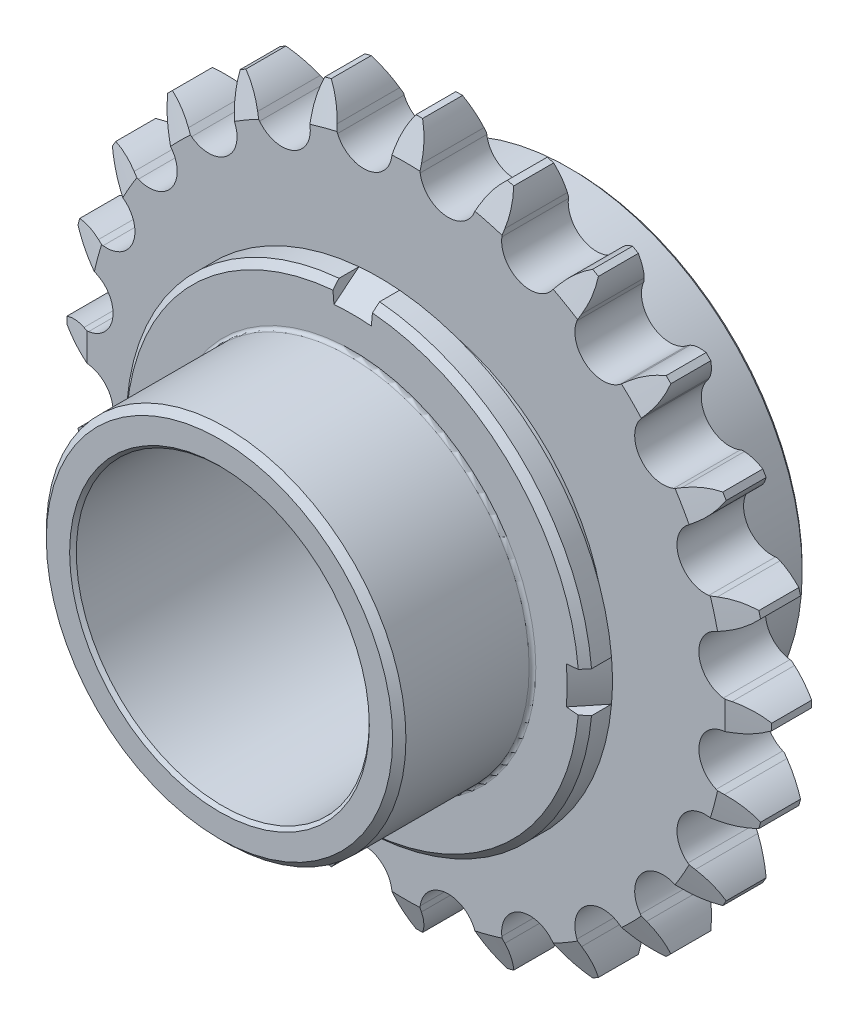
from build123d import *

# Parameters (mm, degrees)
SKETCH2_R                       = 44.394239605
BOSS_EXTRUDE1_DEPTH             = 5
BOSS_EXTRUDE2_REACH             = 64.982
BOSS_EXTRUDE2_DIRECTION_2_REACH = 64.982
CIRPATTERN1_COUNT               = 24
BOSS_EXTRUDE3_DEPTH             = 13
BOSS_EXTRUDE3_DEPTH_BACK        = 20
SKETCH6_R                       = 35
CUT_EXTRUDE1_DEPTH              = 78.467406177
CUT_EXTRUDE1_DEPTH_BACK         = 78.467406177
SKETCH7_R                       = 22
SKETCH9_R                       = 27
SKETCH9_R_2                     = 22
BOSS_EXTRUDE4_DEPTH             = 20
CHAMFER1_SIZE                   = 1
SKETCH10_W                      = 4
SKETCH10_H                      = 10
CUT_REVOLVE9_ANGLE              = 10
CIRPATTERN2_COUNT               = 4
CHAMFER2_SIZE                   = 0.5
FILLET2_R                       = 0.5


with BuildPart() as part:
    # Sketch2 → Boss-Extrude1 (new, symmetric)
    with BuildSketch(Plane.XY):
        Circle(SKETCH2_R)
    extrude(amount=BOSS_EXTRUDE1_DEPTH, both=True)

    # Boss-Extrude2: up to this face of the body (flat: up to its plane)
    boss_extrude2_end = Plane(part.part.faces().sort_by_distance((0, 0, 5))[0])
    # Sketch4 → Boss-Extrude2 (add, up to the picked face)
    with BuildSketch(Plane.XY, mode=Mode.PRIVATE) as boss_extrude2_sk1:
        with BuildLine():
            Line((-0.5, 52.920690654), (0.5, 52.920690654))
            ThreePointArc((0.5, 52.920690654), (1.505944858, 50.872327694), (2.021304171, 48.649239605))
            Line((2.021304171, 48.649239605), (2.13523978, 47.649239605))
            ThreePointArc((2.13523978, 47.649239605), (3.351413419, 45.214180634), (5.794611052, 44.014440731))
            ThreePointArc((5.794611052, 44.014440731), (0, 44.394239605), (-5.794611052, 44.014440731))
            ThreePointArc((-5.794611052, 44.014440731), (-3.351413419, 45.214180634), (-2.13523978, 47.649239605))
            Line((-2.13523978, 47.649239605), (-2.021304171, 48.649239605))
            ThreePointArc((-2.021304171, 48.649239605), (-1.505944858, 50.872327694), (-0.5, 52.920690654))
        make_face()
    boss_extrude2_tool1 = split(extrude(boss_extrude2_sk1.sketch, amount=BOSS_EXTRUDE2_REACH, mode=Mode.PRIVATE), bisect_by=boss_extrude2_end, keep=Keep.BOTH, mode=Mode.PRIVATE)
    boss_extrude2 = boss_extrude2_tool1.solids().sort_by(Axis((0, 47.611932, 0), (0, 0, 1)))[0]
    add(boss_extrude2)

    # Boss-Extrude2 direction 2: up to this face of the body (flat: up to its plane)
    boss_extrude2_direction_2_end = Plane(part.part.faces().sort_by_distance((0, 0, -5))[0])
    # Sketch4 → Boss-Extrude2 direction 2 (add, up to the picked face)
    with BuildSketch(Plane.XY, mode=Mode.PRIVATE) as boss_extrude2_direction_2_sk1:
        with BuildLine():
            Line((-0.5, 52.920690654), (0.5, 52.920690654))
            ThreePointArc((0.5, 52.920690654), (1.505944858, 50.872327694), (2.021304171, 48.649239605))
            Line((2.021304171, 48.649239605), (2.13523978, 47.649239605))
            ThreePointArc((2.13523978, 47.649239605), (3.351413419, 45.214180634), (5.794611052, 44.014440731))
            ThreePointArc((5.794611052, 44.014440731), (0, 44.394239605), (-5.794611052, 44.014440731))
            ThreePointArc((-5.794611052, 44.014440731), (-3.351413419, 45.214180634), (-2.13523978, 47.649239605))
            Line((-2.13523978, 47.649239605), (-2.021304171, 48.649239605))
            ThreePointArc((-2.021304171, 48.649239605), (-1.505944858, 50.872327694), (-0.5, 52.920690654))
        make_face()
    boss_extrude2_direction_2_tool1 = split(extrude(boss_extrude2_direction_2_sk1.sketch, amount=-BOSS_EXTRUDE2_DIRECTION_2_REACH, mode=Mode.PRIVATE), bisect_by=boss_extrude2_direction_2_end, keep=Keep.BOTH, mode=Mode.PRIVATE)
    boss_extrude2_direction_2 = boss_extrude2_direction_2_tool1.solids().sort_by(Axis((0, 47.611932, 0), (0, 0, -1)))[0]
    add(boss_extrude2_direction_2)

    # CirPattern1: Boss-Extrude2, Boss-Extrude2 direction 2 ×24 about axis
    cirpattern1_axis = Axis((0, 0, 0), (0, 0, 1))
    add([boss_extrude2.rotate(cirpattern1_axis, i * 360 / CIRPATTERN1_COUNT) for i in range(1, CIRPATTERN1_COUNT)])
    add([boss_extrude2_direction_2.rotate(cirpattern1_axis, i * 360 / CIRPATTERN1_COUNT) for i in range(1, CIRPATTERN1_COUNT)])

    # Sketch5 → Cut-Revolve7 (revolve, cut)
    with BuildSketch(Plane(origin=(0, 0, 0), x_dir=(0, 0, -1), z_dir=(1, 0, 0))):
        Polygon((0, 60.420690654), (-6, 60.420690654), (-6, 45.420690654), align=None)
        Polygon((6, 60.420690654), (0, 60.420690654), (6, 45.420690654), align=None)
    revolve(axis=Axis((0, 0, 0), (0, 0, 1)), mode=Mode.SUBTRACT)

    # Sketch6 → Boss-Extrude3 (add, two sides: drawn at the far end of the back side and taken through both)
    with BuildSketch(Plane.XY.offset(-BOSS_EXTRUDE3_DEPTH_BACK)):
        Circle(SKETCH6_R)
    extrude(amount=BOSS_EXTRUDE3_DEPTH + BOSS_EXTRUDE3_DEPTH_BACK)

    # Sketch7 → Cut-Extrude1 (cut, two sides: drawn at the far end of the back side and taken through both)
    with BuildSketch(Plane.XY.offset(-CUT_EXTRUDE1_DEPTH_BACK)):
        Circle(SKETCH7_R)
    extrude(amount=CUT_EXTRUDE1_DEPTH + CUT_EXTRUDE1_DEPTH_BACK, mode=Mode.SUBTRACT)

    # Sketch9 → Boss-Extrude4 (add)
    with BuildSketch(Plane.XY.offset(13)):
        Circle(SKETCH9_R)
        Circle(SKETCH9_R_2, mode=Mode.SUBTRACT)
    extrude(amount=BOSS_EXTRUDE4_DEPTH)

    # Chamfer1
    chamfer1_edges = [part.edges().sort_by_distance(p)[0] for p in [
        (-35, 0, 5),
        (-35, 0, 13),
        (-27, 0, 33),
    ]]
    chamfer(chamfer1_edges, length=CHAMFER1_SIZE)

    # Sketch10 → Cut-Revolve8 (revolve, cut)
    with BuildSketch(Plane(origin=(0, 0, 0), x_dir=(0, 0, -1), z_dir=(1, 0, 0)), mode=Mode.PRIVATE) as cut_revolve8_sk:
        with Locations((-7, 35)):
            Rectangle(SKETCH10_W, SKETCH10_H)
    revolve(cut_revolve8_sk.sketch.rotate(Axis((0, 0, -20), (0, 0, 1)), 270), axis=Axis((0, 0, -20), (0, 0, 1)), mode=Mode.SUBTRACT)

    # Sketch11 → Cut-Revolve9 (revolve, symmetric, cut)
    with BuildSketch(Plane(origin=(0, 0, 0), x_dir=(0, 0, -1), z_dir=(1, 0, 0))) as cut_revolve9_sk:
        Polygon((-9, 35), (-13, 32.199169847), (-13, 35), align=None)
    cut_revolve9 = revolve(axis=Axis((0, 0, -20), (0, 0, 1)), revolution_arc=CUT_REVOLVE9_ANGLE / 2, mode=Mode.SUBTRACT)
    cut_revolve9 = cut_revolve9 + revolve(cut_revolve9_sk.sketch, axis=Axis((0, 0, -20), (0, 0, -1)), revolution_arc=CUT_REVOLVE9_ANGLE / 2, mode=Mode.SUBTRACT)

    # CirPattern2: Cut-Revolve9 ×4 about axis
    cirpattern2_axis = Axis((0, 0, -20), (0, 0, 1))
    for i in range(1, CIRPATTERN2_COUNT):
        add(cut_revolve9.rotate(cirpattern2_axis, i * 360 / CIRPATTERN2_COUNT), mode=Mode.SUBTRACT)

    # Chamfer2
    chamfer2_edges = [part.edges().sort_by_distance(p)[0] for p in [
        (-35, 0, -20),
        (-22, 0, -20),
        (-22, 0, 33),
    ]]
    chamfer(chamfer2_edges, length=CHAMFER2_SIZE)

    # Fillet2
    fillet2_edges = [part.edges().sort_by_distance(p)[0] for p in [
        (-35, 0, -5),
        (-27, 0, 13),
    ]]
    fillet(fillet2_edges, radius=FILLET2_R)


solid = part.part
